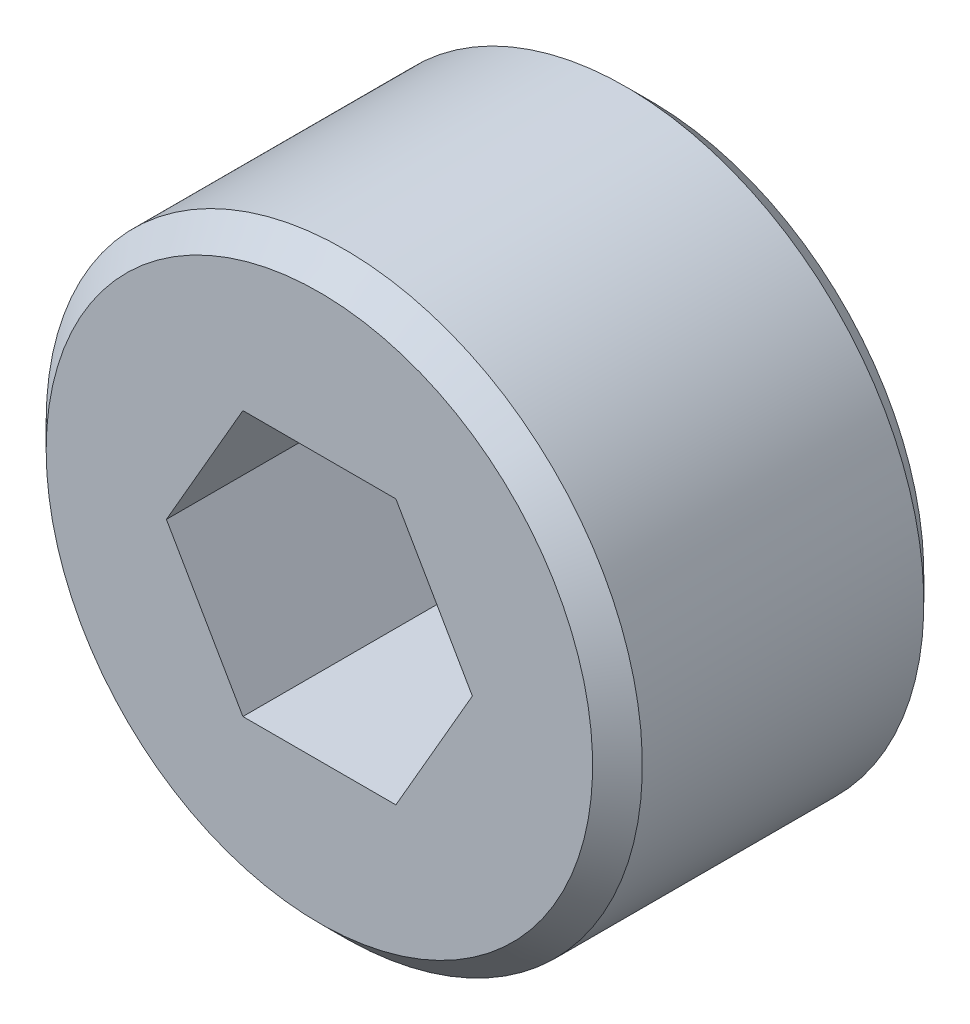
from build123d import *

# Parameters (mm, degrees)
CUT_EXTRUDE1_DEPTH = 13.847966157


with BuildPart() as part:
    # Logo3_bib1 → Revolve1 (revolve)
    with BuildSketch(Plane(origin=(0, 0, 0), x_dir=(-1, 0, 0), z_dir=(0, -1, 0))):
        Polygon((0, -7.9375), (0, 0), (6.54812, 0), (7.14375, -0.59563), (7.14375, -7.34187), (6.54812, -7.9375), align=None)
    revolve(axis=Axis((0, 0, -10.585154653), (0, 0, 1)))

    # Logo3_bib2 → Cut-Extrude1 (cut, through all)
    with BuildSketch(Plane(origin=(0, 0, 0), x_dir=(1, 0, 0), z_dir=(0, 0, -1))):
        Polygon((3.666174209, 0), (1.833087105, 3.175), (-1.833087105, 3.175), (-3.666174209, 0), (-1.833087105, -3.175), (1.833087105, -3.175), align=None)
    extrude(amount=-CUT_EXTRUDE1_DEPTH, mode=Mode.SUBTRACT)


solid = part.part
